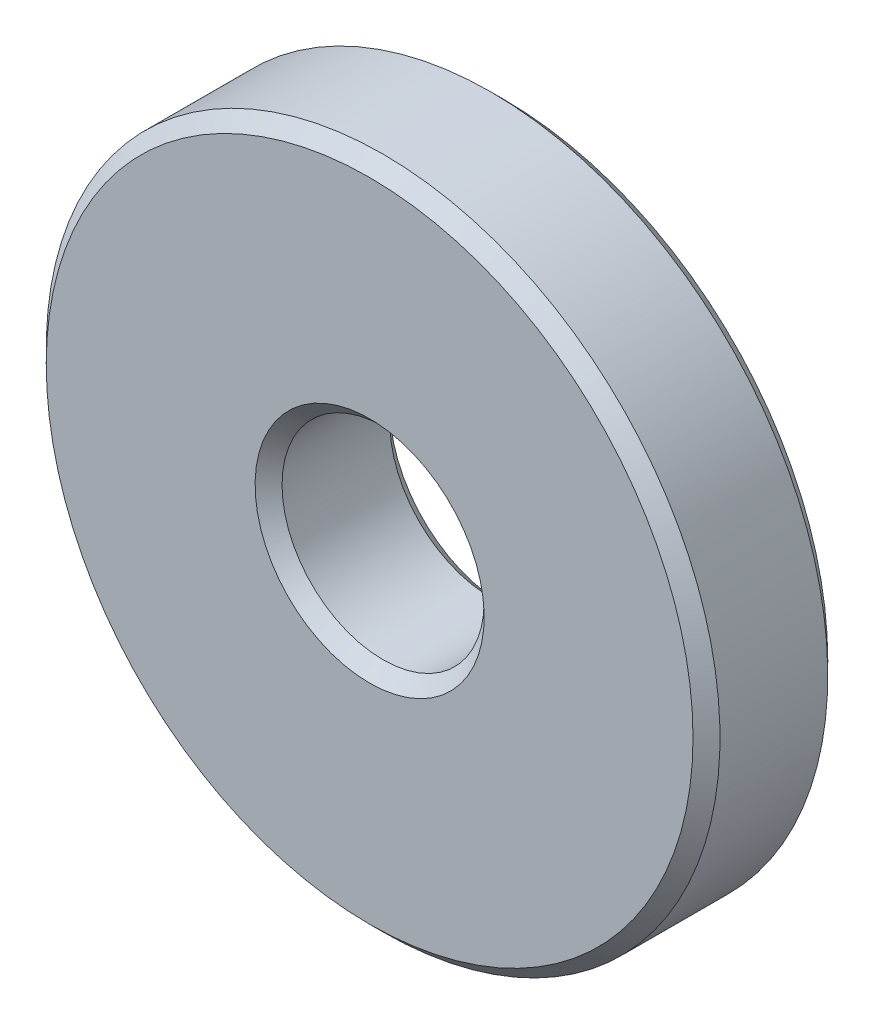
ISO-10303-21;
HEADER;
FILE_DESCRIPTION(('STEP AP214'),'2;1');
FILE_NAME('part.step','',(''),(''),'','','');
FILE_SCHEMA(('AUTOMOTIVE_DESIGN { 1 0 10303 214 1 1 1 1 }'));
ENDSEC;
DATA;
#1=APPLICATION_CONTEXT('core data for automotive mechanical design processes');
#2=APPLICATION_PROTOCOL_DEFINITION('international standard','automotive_design',2000,#1);
#3=PRODUCT_CONTEXT('',#1,'mechanical');
#4=PRODUCT('Part','Part','',(#3));
#5=PRODUCT_RELATED_PRODUCT_CATEGORY('part','',(#4));
#6=PRODUCT_DEFINITION_FORMATION('','',#4);
#7=PRODUCT_DEFINITION_CONTEXT('part definition',#1,'design');
#8=PRODUCT_DEFINITION('design','',#6,#7);
#9=PRODUCT_DEFINITION_SHAPE('','',#8);
#10=(LENGTH_UNIT() NAMED_UNIT(*) SI_UNIT(.MILLI.,.METRE.));
#11=(NAMED_UNIT(*) PLANE_ANGLE_UNIT() SI_UNIT($,.RADIAN.));
#12=(NAMED_UNIT(*) SI_UNIT($,.STERADIAN.) SOLID_ANGLE_UNIT());
#13=UNCERTAINTY_MEASURE_WITH_UNIT(LENGTH_MEASURE(1.E-05),#10,'distance_accuracy_value','');
#14=(GEOMETRIC_REPRESENTATION_CONTEXT(3) GLOBAL_UNCERTAINTY_ASSIGNED_CONTEXT((#13)) GLOBAL_UNIT_ASSIGNED_CONTEXT((#10,
#11,#12)) REPRESENTATION_CONTEXT('',''));
#15=CARTESIAN_POINT('',(0.,0.,0.));
#16=DIRECTION('',(0.,0.,1.));
#17=DIRECTION('',(1.,0.,0.));
#18=AXIS2_PLACEMENT_3D('',#15,#16,#17);
#19=CARTESIAN_POINT('',(0.,0.,0.));
#20=DIRECTION('',(0.,0.,-1.));
#21=DIRECTION('',(0.,1.,0.));
#22=AXIS2_PLACEMENT_3D('',#19,#20,#21);
#23=CYLINDRICAL_SURFACE('',#22,1.5);
#24=CARTESIAN_POINT('',(0.,0.,0.199999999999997));
#25=DIRECTION('',(0.,0.,-1.));
#26=DIRECTION('',(0.,1.,0.));
#27=AXIS2_PLACEMENT_3D('',#24,#25,#26);
#28=CIRCLE('',#27,1.5);
#29=CARTESIAN_POINT('',(0.,1.5,0.199999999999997));
#30=VERTEX_POINT('',#29);
#31=EDGE_CURVE('E38',#30,#30,#28,.T.);
#32=ORIENTED_EDGE('',*,*,#31,.T.);
#33=EDGE_LOOP('',(#32));
#34=FACE_BOUND('',#33,.T.);
#35=CARTESIAN_POINT('',(0.,0.,1.8));
#36=DIRECTION('',(0.,0.,1.));
#37=DIRECTION('',(0.,-1.,0.));
#38=AXIS2_PLACEMENT_3D('',#35,#36,#37);
#39=CIRCLE('',#38,1.5);
#40=CARTESIAN_POINT('',(0.,-1.5,1.8));
#41=VERTEX_POINT('',#40);
#42=EDGE_CURVE('E41',#41,#41,#39,.T.);
#43=ORIENTED_EDGE('',*,*,#42,.T.);
#44=EDGE_LOOP('',(#43));
#45=FACE_BOUND('',#44,.T.);
#46=ADVANCED_FACE('F12',(#34,#45),#23,.F.);
#47=CARTESIAN_POINT('',(1.5,0.,2.));
#48=DIRECTION('',(0.,0.,1.));
#49=DIRECTION('',(0.,-1.,0.));
#50=AXIS2_PLACEMENT_3D('',#47,#48,#49);
#51=PLANE('',#50);
#52=CARTESIAN_POINT('',(0.,0.,2.));
#53=DIRECTION('',(0.,0.,1.));
#54=DIRECTION('',(0.,-1.,0.));
#55=AXIS2_PLACEMENT_3D('',#52,#53,#54);
#56=CIRCLE('',#55,1.7);
#57=CARTESIAN_POINT('',(0.,-1.7,2.));
#58=VERTEX_POINT('',#57);
#59=EDGE_CURVE('E23',#58,#58,#56,.F.);
#60=ORIENTED_EDGE('',*,*,#59,.T.);
#61=EDGE_LOOP('',(#60));
#62=FACE_BOUND('',#61,.T.);
#63=CARTESIAN_POINT('',(0.,0.,2.));
#64=DIRECTION('',(0.,0.,1.));
#65=DIRECTION('',(0.,-1.,0.));
#66=AXIS2_PLACEMENT_3D('',#63,#64,#65);
#67=CIRCLE('',#66,4.8);
#68=CARTESIAN_POINT('',(0.,-4.8,2.));
#69=VERTEX_POINT('',#68);
#70=EDGE_CURVE('E27',#69,#69,#67,.T.);
#71=ORIENTED_EDGE('',*,*,#70,.T.);
#72=EDGE_LOOP('',(#71));
#73=FACE_BOUND('',#72,.T.);
#74=ADVANCED_FACE('F54',(#62,#73),#51,.T.);
#75=CARTESIAN_POINT('',(0.,0.,0.));
#76=DIRECTION('',(0.,0.,-1.));
#77=DIRECTION('',(0.,1.,0.));
#78=AXIS2_PLACEMENT_3D('',#75,#76,#77);
#79=CYLINDRICAL_SURFACE('',#78,5.);
#80=CARTESIAN_POINT('',(0.,0.,0.200000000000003));
#81=DIRECTION('',(0.,0.,-1.));
#82=DIRECTION('',(0.,1.,0.));
#83=AXIS2_PLACEMENT_3D('',#80,#81,#82);
#84=CIRCLE('',#83,5.);
#85=CARTESIAN_POINT('',(0.,5.,0.200000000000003));
#86=VERTEX_POINT('',#85);
#87=EDGE_CURVE('E8',#86,#86,#84,.F.);
#88=ORIENTED_EDGE('',*,*,#87,.T.);
#89=EDGE_LOOP('',(#88));
#90=FACE_BOUND('',#89,.T.);
#91=CARTESIAN_POINT('',(0.,0.,1.8));
#92=DIRECTION('',(0.,0.,1.));
#93=DIRECTION('',(0.,-1.,0.));
#94=AXIS2_PLACEMENT_3D('',#91,#92,#93);
#95=CIRCLE('',#94,5.);
#96=CARTESIAN_POINT('',(0.,-5.,1.8));
#97=VERTEX_POINT('',#96);
#98=EDGE_CURVE('E19',#97,#97,#95,.F.);
#99=ORIENTED_EDGE('',*,*,#98,.T.);
#100=EDGE_LOOP('',(#99));
#101=FACE_BOUND('',#100,.T.);
#102=ADVANCED_FACE('F57',(#90,#101),#79,.T.);
#103=CARTESIAN_POINT('',(1.5,0.,0.));
#104=DIRECTION('',(0.,0.,-1.));
#105=DIRECTION('',(0.,1.,0.));
#106=AXIS2_PLACEMENT_3D('',#103,#104,#105);
#107=PLANE('',#106);
#108=CARTESIAN_POINT('',(0.,0.,0.));
#109=DIRECTION('',(0.,0.,-1.));
#110=DIRECTION('',(0.,1.,0.));
#111=AXIS2_PLACEMENT_3D('',#108,#109,#110);
#112=CIRCLE('',#111,1.7);
#113=CARTESIAN_POINT('',(0.,1.7,0.));
#114=VERTEX_POINT('',#113);
#115=EDGE_CURVE('E32',#114,#114,#112,.F.);
#116=ORIENTED_EDGE('',*,*,#115,.T.);
#117=EDGE_LOOP('',(#116));
#118=FACE_BOUND('',#117,.T.);
#119=CARTESIAN_POINT('',(0.,0.,0.));
#120=DIRECTION('',(0.,0.,-1.));
#121=DIRECTION('',(0.,1.,0.));
#122=AXIS2_PLACEMENT_3D('',#119,#120,#121);
#123=CIRCLE('',#122,4.8);
#124=CARTESIAN_POINT('',(0.,4.8,0.));
#125=VERTEX_POINT('',#124);
#126=EDGE_CURVE('E35',#125,#125,#123,.T.);
#127=ORIENTED_EDGE('',*,*,#126,.T.);
#128=EDGE_LOOP('',(#127));
#129=FACE_BOUND('',#128,.T.);
#130=ADVANCED_FACE('F78',(#118,#129),#107,.T.);
#131=CARTESIAN_POINT('',(0.,0.,0.199999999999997));
#132=DIRECTION('',(0.,0.,-1.));
#133=DIRECTION('',(0.,1.,0.));
#134=AXIS2_PLACEMENT_3D('',#131,#132,#133);
#135=CONICAL_SURFACE('',#134,1.5,0.785398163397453);
#136=ORIENTED_EDGE('',*,*,#115,.F.);
#137=EDGE_LOOP('',(#136));
#138=FACE_BOUND('',#137,.T.);
#139=ORIENTED_EDGE('',*,*,#31,.F.);
#140=EDGE_LOOP('',(#139));
#141=FACE_BOUND('',#140,.T.);
#142=ADVANCED_FACE('F50',(#138,#141),#135,.F.);
#143=CARTESIAN_POINT('',(0.,0.,2.));
#144=DIRECTION('',(0.,0.,1.));
#145=DIRECTION('',(0.,-1.,0.));
#146=AXIS2_PLACEMENT_3D('',#143,#144,#145);
#147=CONICAL_SURFACE('',#146,1.7,0.785398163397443);
#148=ORIENTED_EDGE('',*,*,#42,.F.);
#149=EDGE_LOOP('',(#148));
#150=FACE_BOUND('',#149,.T.);
#151=ORIENTED_EDGE('',*,*,#59,.F.);
#152=EDGE_LOOP('',(#151));
#153=FACE_BOUND('',#152,.T.);
#154=ADVANCED_FACE('F46',(#150,#153),#147,.F.);
#155=CARTESIAN_POINT('',(0.,0.,0.));
#156=DIRECTION('',(0.,0.,1.));
#157=DIRECTION('',(0.,-1.,0.));
#158=AXIS2_PLACEMENT_3D('',#155,#156,#157);
#159=CONICAL_SURFACE('',#158,4.8,0.785398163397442);
#160=ORIENTED_EDGE('',*,*,#87,.F.);
#161=EDGE_LOOP('',(#160));
#162=FACE_BOUND('',#161,.T.);
#163=ORIENTED_EDGE('',*,*,#126,.F.);
#164=EDGE_LOOP('',(#163));
#165=FACE_BOUND('',#164,.T.);
#166=ADVANCED_FACE('F49',(#162,#165),#159,.T.);
#167=CARTESIAN_POINT('',(0.,0.,1.8));
#168=DIRECTION('',(0.,0.,-1.));
#169=DIRECTION('',(0.,1.,0.));
#170=AXIS2_PLACEMENT_3D('',#167,#168,#169);
#171=CONICAL_SURFACE('',#170,5.,0.78539816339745);
#172=ORIENTED_EDGE('',*,*,#70,.F.);
#173=EDGE_LOOP('',(#172));
#174=FACE_BOUND('',#173,.T.);
#175=ORIENTED_EDGE('',*,*,#98,.F.);
#176=EDGE_LOOP('',(#175));
#177=FACE_BOUND('',#176,.T.);
#178=ADVANCED_FACE('F14',(#174,#177),#171,.T.);
#179=CLOSED_SHELL('',(#46,#74,#102,#130,#142,#154,#166,#178));
#180=MANIFOLD_SOLID_BREP('B1',#179);
#181=ADVANCED_BREP_SHAPE_REPRESENTATION('',(#18,#180),#14);
#182=SHAPE_DEFINITION_REPRESENTATION(#9,#181);
ENDSEC;
END-ISO-10303-21;
